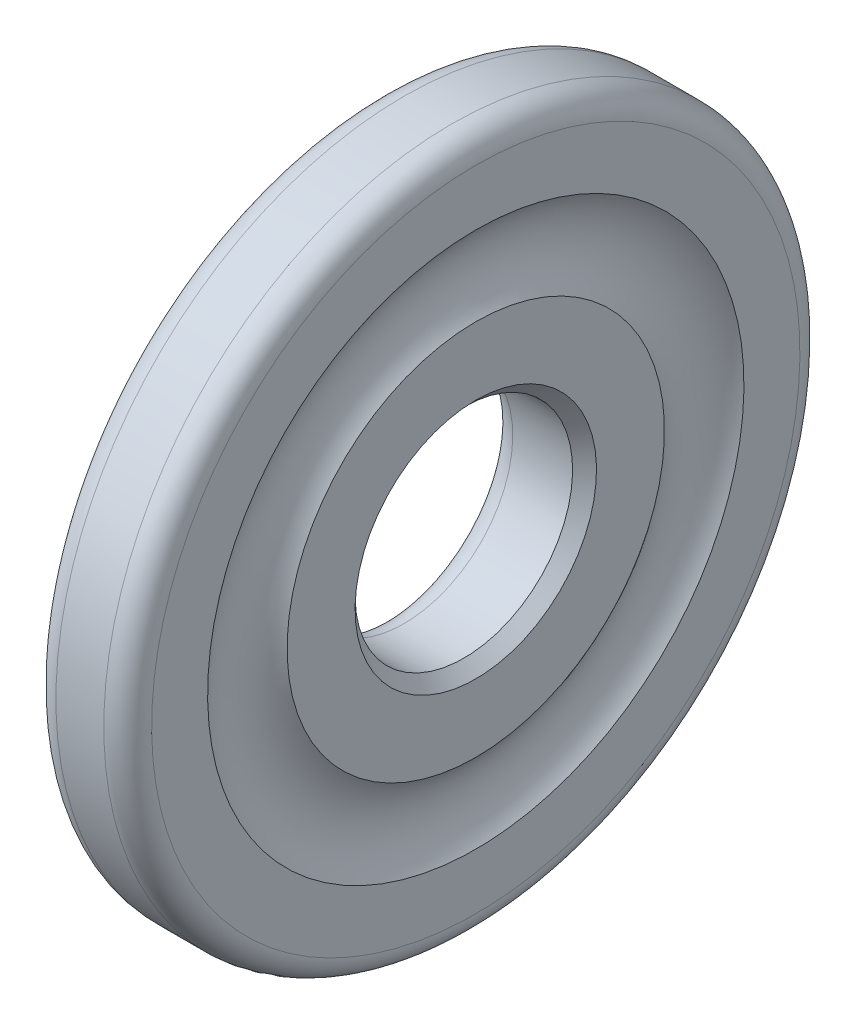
ISO-10303-21;
HEADER;
FILE_DESCRIPTION(('STEP AP214'),'2;1');
FILE_NAME('part.step','',(''),(''),'','','');
FILE_SCHEMA(('AUTOMOTIVE_DESIGN { 1 0 10303 214 1 1 1 1 }'));
ENDSEC;
DATA;
#1=APPLICATION_CONTEXT('core data for automotive mechanical design processes');
#2=APPLICATION_PROTOCOL_DEFINITION('international standard','automotive_design',2000,#1);
#3=PRODUCT_CONTEXT('',#1,'mechanical');
#4=PRODUCT('Part','Part','',(#3));
#5=PRODUCT_RELATED_PRODUCT_CATEGORY('part','',(#4));
#6=PRODUCT_DEFINITION_FORMATION('','',#4);
#7=PRODUCT_DEFINITION_CONTEXT('part definition',#1,'design');
#8=PRODUCT_DEFINITION('design','',#6,#7);
#9=PRODUCT_DEFINITION_SHAPE('','',#8);
#10=(LENGTH_UNIT() NAMED_UNIT(*) SI_UNIT(.MILLI.,.METRE.));
#11=(NAMED_UNIT(*) PLANE_ANGLE_UNIT() SI_UNIT($,.RADIAN.));
#12=(NAMED_UNIT(*) SI_UNIT($,.STERADIAN.) SOLID_ANGLE_UNIT());
#13=UNCERTAINTY_MEASURE_WITH_UNIT(LENGTH_MEASURE(1.E-05),#10,'distance_accuracy_value','');
#14=(GEOMETRIC_REPRESENTATION_CONTEXT(3) GLOBAL_UNCERTAINTY_ASSIGNED_CONTEXT((#13)) GLOBAL_UNIT_ASSIGNED_CONTEXT((#10,
#11,#12)) REPRESENTATION_CONTEXT('',''));
#15=CARTESIAN_POINT('',(0.,0.,0.));
#16=DIRECTION('',(0.,0.,1.));
#17=DIRECTION('',(1.,0.,0.));
#18=AXIS2_PLACEMENT_3D('',#15,#16,#17);
#19=CARTESIAN_POINT('',(0.,10.5,0.));
#20=DIRECTION('',(-1.,0.,0.));
#21=DIRECTION('',(0.,0.,1.));
#22=AXIS2_PLACEMENT_3D('',#19,#20,#21);
#23=PLANE('',#22);
#24=CARTESIAN_POINT('',(0.,0.,0.));
#25=DIRECTION('',(-1.,0.,0.));
#26=DIRECTION('',(0.,1.,0.));
#27=AXIS2_PLACEMENT_3D('',#24,#25,#26);
#28=CIRCLE('',#27,6.1);
#29=CARTESIAN_POINT('',(0.,6.1,0.));
#30=VERTEX_POINT('',#29);
#31=EDGE_CURVE('E31',#30,#30,#28,.T.);
#32=ORIENTED_EDGE('',*,*,#31,.F.);
#33=EDGE_LOOP('',(#32));
#34=FACE_BOUND('',#33,.T.);
#35=CARTESIAN_POINT('',(0.,0.,0.));
#36=DIRECTION('',(-1.,0.,0.));
#37=DIRECTION('',(0.,1.,0.));
#38=AXIS2_PLACEMENT_3D('',#35,#36,#37);
#39=CIRCLE('',#38,14.9);
#40=CARTESIAN_POINT('',(0.,14.9,0.));
#41=VERTEX_POINT('',#40);
#42=EDGE_CURVE('E10',#41,#41,#39,.T.);
#43=ORIENTED_EDGE('',*,*,#42,.T.);
#44=EDGE_LOOP('',(#43));
#45=FACE_BOUND('',#44,.T.);
#46=ADVANCED_FACE('F15',(#34,#45),#23,.T.);
#47=CARTESIAN_POINT('',(4.4,13.613728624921,0.));
#48=DIRECTION('',(1.,0.,0.));
#49=DIRECTION('',(0.,0.,-1.));
#50=AXIS2_PLACEMENT_3D('',#47,#48,#49);
#51=PLANE('',#50);
#52=CARTESIAN_POINT('',(4.4,0.,0.));
#53=DIRECTION('',(-1.,0.,0.));
#54=DIRECTION('',(0.,1.,0.));
#55=AXIS2_PLACEMENT_3D('',#52,#53,#54);
#56=CIRCLE('',#55,12.327457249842);
#57=CARTESIAN_POINT('',(4.4,12.327457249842,0.));
#58=VERTEX_POINT('',#57);
#59=EDGE_CURVE('E23',#58,#58,#56,.T.);
#60=ORIENTED_EDGE('',*,*,#59,.T.);
#61=EDGE_LOOP('',(#60));
#62=FACE_BOUND('',#61,.T.);
#63=CARTESIAN_POINT('',(4.4,0.,0.));
#64=DIRECTION('',(-1.,0.,0.));
#65=DIRECTION('',(0.,1.,0.));
#66=AXIS2_PLACEMENT_3D('',#63,#64,#65);
#67=CIRCLE('',#66,14.9);
#68=CARTESIAN_POINT('',(4.4,14.9,0.));
#69=VERTEX_POINT('',#68);
#70=EDGE_CURVE('E40',#69,#69,#67,.T.);
#71=ORIENTED_EDGE('',*,*,#70,.F.);
#72=EDGE_LOOP('',(#71));
#73=FACE_BOUND('',#72,.T.);
#74=ADVANCED_FACE('F89',(#62,#73),#51,.T.);
#75=CARTESIAN_POINT('',(4.4,7.11127137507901,0.));
#76=DIRECTION('',(1.,0.,0.));
#77=DIRECTION('',(0.,0.,-1.));
#78=AXIS2_PLACEMENT_3D('',#75,#76,#77);
#79=PLANE('',#78);
#80=CARTESIAN_POINT('',(4.4,0.,0.));
#81=DIRECTION('',(-1.,0.,0.));
#82=DIRECTION('',(0.,1.,0.));
#83=AXIS2_PLACEMENT_3D('',#80,#81,#82);
#84=CIRCLE('',#83,5.55);
#85=CARTESIAN_POINT('',(4.4,5.55,0.));
#86=VERTEX_POINT('',#85);
#87=EDGE_CURVE('E28',#86,#86,#84,.T.);
#88=ORIENTED_EDGE('',*,*,#87,.T.);
#89=EDGE_LOOP('',(#88));
#90=FACE_BOUND('',#89,.T.);
#91=CARTESIAN_POINT('',(4.4,0.,0.));
#92=DIRECTION('',(-1.,0.,0.));
#93=DIRECTION('',(0.,1.,0.));
#94=AXIS2_PLACEMENT_3D('',#91,#92,#93);
#95=CIRCLE('',#94,8.67254275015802);
#96=CARTESIAN_POINT('',(4.4,8.67254275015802,0.));
#97=VERTEX_POINT('',#96);
#98=EDGE_CURVE('E47',#97,#97,#95,.T.);
#99=ORIENTED_EDGE('',*,*,#98,.F.);
#100=EDGE_LOOP('',(#99));
#101=FACE_BOUND('',#100,.T.);
#102=ADVANCED_FACE('F61',(#90,#101),#79,.T.);
#103=CARTESIAN_POINT('',(1.1,0.,0.));
#104=DIRECTION('',(-1.,0.,0.));
#105=DIRECTION('',(0.,0.,1.));
#106=AXIS2_PLACEMENT_3D('',#103,#104,#105);
#107=TOROIDAL_SURFACE('',#106,6.1,1.1);
#108=ORIENTED_EDGE('',*,*,#31,.T.);
#109=EDGE_LOOP('',(#108));
#110=FACE_BOUND('',#109,.T.);
#111=CARTESIAN_POINT('',(1.1,0.,0.));
#112=DIRECTION('',(-1.,0.,0.));
#113=DIRECTION('',(0.,1.,0.));
#114=AXIS2_PLACEMENT_3D('',#111,#112,#113);
#115=CIRCLE('',#114,5.);
#116=CARTESIAN_POINT('',(1.1,5.,0.));
#117=VERTEX_POINT('',#116);
#118=EDGE_CURVE('E41',#117,#117,#115,.T.);
#119=ORIENTED_EDGE('',*,*,#118,.F.);
#120=EDGE_LOOP('',(#119));
#121=FACE_BOUND('',#120,.T.);
#122=ADVANCED_FACE('F57',(#110,#121),#107,.T.);
#123=CARTESIAN_POINT('',(2.475,0.,0.));
#124=DIRECTION('',(-1.,0.,0.));
#125=DIRECTION('',(0.,0.,1.));
#126=AXIS2_PLACEMENT_3D('',#123,#124,#125);
#127=CYLINDRICAL_SURFACE('',#126,5.);
#128=CARTESIAN_POINT('',(3.85,0.,0.));
#129=DIRECTION('',(-1.,0.,0.));
#130=DIRECTION('',(0.,1.,0.));
#131=AXIS2_PLACEMENT_3D('',#128,#129,#130);
#132=CIRCLE('',#131,5.);
#133=CARTESIAN_POINT('',(3.85,5.,0.));
#134=VERTEX_POINT('',#133);
#135=EDGE_CURVE('E44',#134,#134,#132,.T.);
#136=ORIENTED_EDGE('',*,*,#135,.F.);
#137=EDGE_LOOP('',(#136));
#138=FACE_BOUND('',#137,.T.);
#139=ORIENTED_EDGE('',*,*,#118,.T.);
#140=EDGE_LOOP('',(#139));
#141=FACE_BOUND('',#140,.T.);
#142=ADVANCED_FACE('F17',(#138,#141),#127,.F.);
#143=DIRECTION('',(0.707106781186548,0.707106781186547,0.));
#144=VECTOR('',#143,1.);
#145=CARTESIAN_POINT('',(498998.85,499000.,-1.22215714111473E-10));
#146=LINE('',#145,#144);
#147=CARTESIAN_POINT('',(-1.15,0.,0.));
#148=DIRECTION('',(1.,0.,0.));
#149=AXIS1_PLACEMENT('',#147,#148);
#150=SURFACE_OF_REVOLUTION('',#146,#149);
#151=ORIENTED_EDGE('',*,*,#87,.F.);
#152=EDGE_LOOP('',(#151));
#153=FACE_BOUND('',#152,.T.);
#154=ORIENTED_EDGE('',*,*,#135,.T.);
#155=EDGE_LOOP('',(#154));
#156=FACE_BOUND('',#155,.T.);
#157=ADVANCED_FACE('F64',(#153,#156),#150,.F.);
#158=CARTESIAN_POINT('',(6.6,0.,0.));
#159=DIRECTION('',(-1.,0.,0.));
#160=DIRECTION('',(0.,0.,1.));
#161=AXIS2_PLACEMENT_3D('',#158,#159,#160);
#162=TOROIDAL_SURFACE('',#161,10.5,2.86);
#163=ORIENTED_EDGE('',*,*,#98,.T.);
#164=EDGE_LOOP('',(#163));
#165=FACE_BOUND('',#164,.T.);
#166=ORIENTED_EDGE('',*,*,#59,.F.);
#167=EDGE_LOOP('',(#166));
#168=FACE_BOUND('',#167,.T.);
#169=ADVANCED_FACE('F67',(#165,#168),#162,.F.);
#170=CARTESIAN_POINT('',(3.3,0.,0.));
#171=DIRECTION('',(-1.,0.,0.));
#172=DIRECTION('',(0.,0.,1.));
#173=AXIS2_PLACEMENT_3D('',#170,#171,#172);
#174=TOROIDAL_SURFACE('',#173,14.9,1.1);
#175=ORIENTED_EDGE('',*,*,#70,.T.);
#176=EDGE_LOOP('',(#175));
#177=FACE_BOUND('',#176,.T.);
#178=CARTESIAN_POINT('',(3.3,0.,0.));
#179=DIRECTION('',(-1.,0.,0.));
#180=DIRECTION('',(0.,1.,0.));
#181=AXIS2_PLACEMENT_3D('',#178,#179,#180);
#182=CIRCLE('',#181,16.);
#183=CARTESIAN_POINT('',(3.3,16.,0.));
#184=VERTEX_POINT('',#183);
#185=EDGE_CURVE('E37',#184,#184,#182,.T.);
#186=ORIENTED_EDGE('',*,*,#185,.F.);
#187=EDGE_LOOP('',(#186));
#188=FACE_BOUND('',#187,.T.);
#189=ADVANCED_FACE('F71',(#177,#188),#174,.T.);
#190=CARTESIAN_POINT('',(2.2,0.,0.));
#191=DIRECTION('',(-1.,0.,0.));
#192=DIRECTION('',(0.,0.,1.));
#193=AXIS2_PLACEMENT_3D('',#190,#191,#192);
#194=CYLINDRICAL_SURFACE('',#193,16.);
#195=CARTESIAN_POINT('',(1.1,0.,0.));
#196=DIRECTION('',(-1.,0.,0.));
#197=DIRECTION('',(0.,1.,0.));
#198=AXIS2_PLACEMENT_3D('',#195,#196,#197);
#199=CIRCLE('',#198,16.);
#200=CARTESIAN_POINT('',(1.1,16.,0.));
#201=VERTEX_POINT('',#200);
#202=EDGE_CURVE('E34',#201,#201,#199,.T.);
#203=ORIENTED_EDGE('',*,*,#202,.F.);
#204=EDGE_LOOP('',(#203));
#205=FACE_BOUND('',#204,.T.);
#206=ORIENTED_EDGE('',*,*,#185,.T.);
#207=EDGE_LOOP('',(#206));
#208=FACE_BOUND('',#207,.T.);
#209=ADVANCED_FACE('F77',(#205,#208),#194,.T.);
#210=CARTESIAN_POINT('',(1.1,0.,0.));
#211=DIRECTION('',(-1.,0.,0.));
#212=DIRECTION('',(0.,0.,1.));
#213=AXIS2_PLACEMENT_3D('',#210,#211,#212);
#214=TOROIDAL_SURFACE('',#213,14.9,1.1);
#215=ORIENTED_EDGE('',*,*,#202,.T.);
#216=EDGE_LOOP('',(#215));
#217=FACE_BOUND('',#216,.T.);
#218=ORIENTED_EDGE('',*,*,#42,.F.);
#219=EDGE_LOOP('',(#218));
#220=FACE_BOUND('',#219,.T.);
#221=ADVANCED_FACE('F80',(#217,#220),#214,.T.);
#222=CLOSED_SHELL('',(#46,#74,#102,#122,#142,#157,#169,#189,#209,#221));
#223=MANIFOLD_SOLID_BREP('B1',#222);
#224=ADVANCED_BREP_SHAPE_REPRESENTATION('',(#18,#223),#14);
#225=SHAPE_DEFINITION_REPRESENTATION(#9,#224);
ENDSEC;
END-ISO-10303-21;
